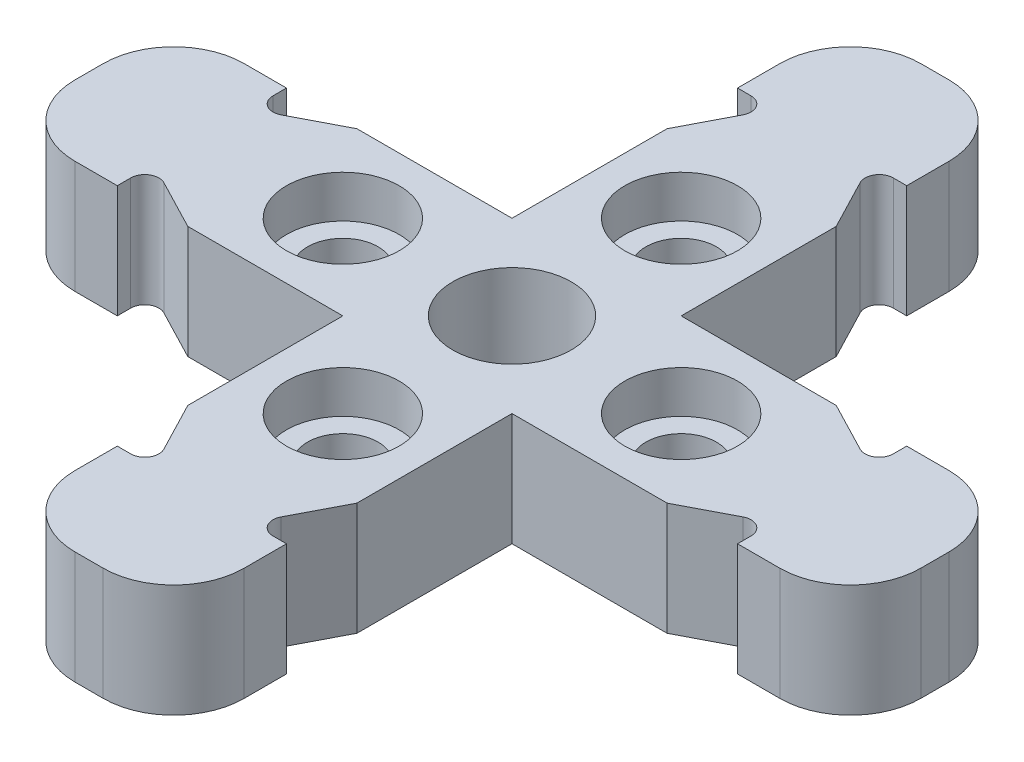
from build123d import *

# Parameters (mm, degrees)
AUFSATZ_LINEAR_AUSTRAGEN1_DEPTH = 4
VERRUNDUNG1_R                   = 2.5
SKIZZE3_R                       = 1.25
SCHNITT_LINEAR_AUSTRAGEN1_DEPTH = 4
SKIZZE4_R                       = 2
SCHNITT_LINEAR_AUSTRAGEN2_DEPTH = 1.5
SKIZZE5_R                       = 2.1
SCHNITT_LINEAR_AUSTRAGEN3_DEPTH = 22.587033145


with BuildPart() as part:
    # Skizze1 → Aufsatz-Linear austragen1 (new body)
    with BuildSketch(Plane(origin=(0, 0, 0), x_dir=(1, 0, 0), z_dir=(0, 1, 0))):
        with BuildLine():
            Line((3, 15), (-3, 15))
            Line((-3, 15), (-3, 11))
            Line((-3, 11), (-2.523560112, 11))
            ThreePointArc((-2.523560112, 11), (-2.096162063, 10.759481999), (-2.079951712, 10.269323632))
            Line((-2.079951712, 10.269323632), (-3, 8.5))
            Line((-3, 8.5), (-3, 3))
            Line((-3, 3), (-8.5, 3))
            Line((-8.5, 3), (-10.269323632, 2.079951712))
            ThreePointArc((-10.269323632, 2.079951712), (-10.759481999, 2.096162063), (-11, 2.523560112))
            Line((-11, 2.523560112), (-11, 3))
            Line((-11, 3), (-15, 3))
            Line((-15, 3), (-15, -3))
            Line((-15, -3), (-11, -3))
            Line((-11, -3), (-11, -2.523560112))
            ThreePointArc((-11, -2.523560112), (-10.759481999, -2.096162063), (-10.269323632, -2.079951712))
            Line((-10.269323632, -2.079951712), (-8.5, -3))
            Line((-8.5, -3), (-3, -3))
            Line((-3, -3), (-3, -8.5))
            Line((-3, -8.5), (-2.079951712, -10.269323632))
            ThreePointArc((-2.079951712, -10.269323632), (-2.096162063, -10.759481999), (-2.523560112, -11))
            Line((-2.523560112, -11), (-3, -11))
            Line((-3, -11), (-3, -15))
            Line((-3, -15), (3, -15))
            Line((3, -15), (3, -11))
            Line((3, -11), (2.523560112, -11))
            ThreePointArc((2.523560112, -11), (2.096162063, -10.759481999), (2.079951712, -10.269323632))
            Line((2.079951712, -10.269323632), (3, -8.5))
            Line((3, -8.5), (3, -3))
            Line((3, -3), (8.5, -3))
            Line((8.5, -3), (10.269323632, -2.079951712))
            ThreePointArc((10.269323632, -2.079951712), (10.759481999, -2.096162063), (11, -2.523560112))
            Line((11, -2.523560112), (11, -3))
            Line((11, -3), (15, -3))
            Line((15, -3), (15, 3))
            Line((15, 3), (11, 3))
            Line((11, 3), (11, 2.523560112))
            ThreePointArc((11, 2.523560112), (10.759481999, 2.096162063), (10.269323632, 2.079951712))
            Line((10.269323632, 2.079951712), (8.5, 3))
            Line((8.5, 3), (3, 3))
            Line((3, 3), (3, 8.5))
            Line((3, 8.5), (2.079951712, 10.269323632))
            ThreePointArc((2.079951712, 10.269323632), (2.096162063, 10.759481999), (2.523560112, 11))
            Line((2.523560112, 11), (3, 11))
            Line((3, 11), (3, 15))
        make_face()
    extrude(amount=AUFSATZ_LINEAR_AUSTRAGEN1_DEPTH)

    # Verrundung1
    verrundung1_edges = [part.edges().sort_by_distance(p)[0] for p in [
        (15, 2, -3),
        (15, 2, 3),
        (3, 2, 15),
        (-3, 2, 15),
        (-15, 2, 3),
        (-15, 2, -3),
        (-3, 2, -15),
        (3, 2, -15),
    ]]
    fillet(verrundung1_edges, radius=VERRUNDUNG1_R)

    # Skizze3 → Schnitt-Linear austragen1 (cut)
    with BuildSketch(Plane(origin=(0, 4, 0), x_dir=(1, 0, 0), z_dir=(0, 1, 0))):
        with Locations(Location((0, 6, 0), (0, 0, 270))):
            Circle(SKIZZE3_R)
        with Locations(Location((6, 0, 0), (0, 0, 270))):
            Circle(SKIZZE3_R)
        with Locations(Location((0, -6, 0), (0, 0, 270))):
            Circle(SKIZZE3_R)
        with Locations(Location((-6, 0, 0), (0, 0, 270))):
            Circle(SKIZZE3_R)
    extrude(amount=-SCHNITT_LINEAR_AUSTRAGEN1_DEPTH, mode=Mode.SUBTRACT)

    # Skizze4 → Schnitt-Linear austragen2 (cut)
    with BuildSketch(Plane(origin=(0, 4, 0), x_dir=(1, 0, 0), z_dir=(0, 1, 0))):
        with Locations(Location((0, 6, 0), (0, 0, 270))):
            Circle(SKIZZE4_R)
        with Locations(Location((6, 0, 0), (0, 0, 270))):
            Circle(SKIZZE4_R)
        with Locations(Location((0, -6, 0), (0, 0, 270))):
            Circle(SKIZZE4_R)
        with Locations(Location((-6, 0, 0), (0, 0, 270))):
            Circle(SKIZZE4_R)
    extrude(amount=-SCHNITT_LINEAR_AUSTRAGEN2_DEPTH, mode=Mode.SUBTRACT)

    # Skizze5 → Schnitt-Linear austragen3 (cut, through all)
    with BuildSketch(Plane(origin=(0, 4, 0), x_dir=(1, 0, 0), z_dir=(0, 1, 0))):
        with Locations(Location((0, 0, 0), (0, 0, 270))):
            Circle(SKIZZE5_R)
    extrude(amount=-SCHNITT_LINEAR_AUSTRAGEN3_DEPTH, mode=Mode.SUBTRACT)


solid = part.part
